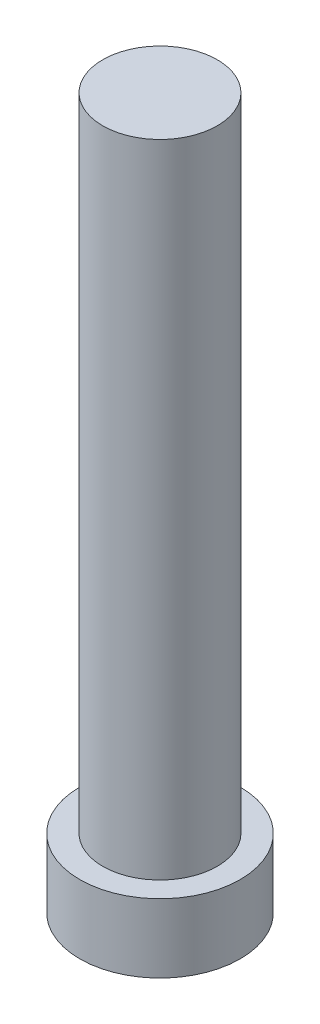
from build123d import *


with BuildPart() as part:
    # Esquisse1 → Base-R_volution (revolve)
    with BuildSketch(Plane.XY, mode=Mode.PRIVATE) as base_r_volution_sk:
        Polygon((0, 0), (-7, 0), (-7, 6), (-5, 6), (-5, 62), (0, 62), align=None)
    revolve(base_r_volution_sk.sketch.rotate(Axis((0, 49.432307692, 0), (0, -1, 0)), 270), axis=Axis((0, 49.432307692, 0), (0, -1, 0)))


solid = part.part
